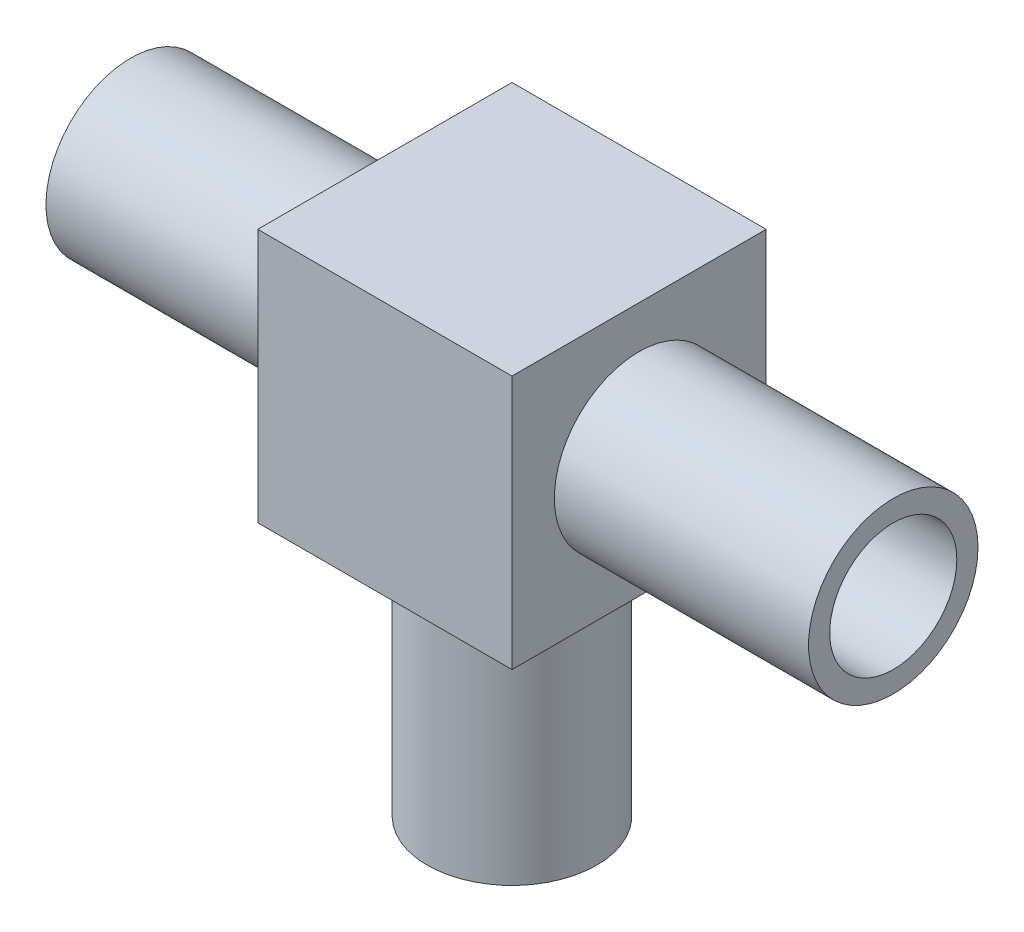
ISO-10303-21;
HEADER;
FILE_DESCRIPTION(('STEP AP214'),'2;1');
FILE_NAME('part.step','',(''),(''),'','','');
FILE_SCHEMA(('AUTOMOTIVE_DESIGN { 1 0 10303 214 1 1 1 1 }'));
ENDSEC;
DATA;
#1=APPLICATION_CONTEXT('core data for automotive mechanical design processes');
#2=APPLICATION_PROTOCOL_DEFINITION('international standard','automotive_design',2000,#1);
#3=PRODUCT_CONTEXT('',#1,'mechanical');
#4=PRODUCT('Part','Part','',(#3));
#5=PRODUCT_RELATED_PRODUCT_CATEGORY('part','',(#4));
#6=PRODUCT_DEFINITION_FORMATION('','',#4);
#7=PRODUCT_DEFINITION_CONTEXT('part definition',#1,'design');
#8=PRODUCT_DEFINITION('design','',#6,#7);
#9=PRODUCT_DEFINITION_SHAPE('','',#8);
#10=(LENGTH_UNIT() NAMED_UNIT(*) SI_UNIT(.MILLI.,.METRE.));
#11=(NAMED_UNIT(*) PLANE_ANGLE_UNIT() SI_UNIT($,.RADIAN.));
#12=(NAMED_UNIT(*) SI_UNIT($,.STERADIAN.) SOLID_ANGLE_UNIT());
#13=UNCERTAINTY_MEASURE_WITH_UNIT(LENGTH_MEASURE(1.E-05),#10,'distance_accuracy_value','');
#14=(GEOMETRIC_REPRESENTATION_CONTEXT(3) GLOBAL_UNCERTAINTY_ASSIGNED_CONTEXT((#13)) GLOBAL_UNIT_ASSIGNED_CONTEXT((#10,
#11,#12)) REPRESENTATION_CONTEXT('',''));
#15=CARTESIAN_POINT('',(0.,0.,0.));
#16=DIRECTION('',(0.,0.,1.));
#17=DIRECTION('',(1.,0.,0.));
#18=AXIS2_PLACEMENT_3D('',#15,#16,#17);
#19=CARTESIAN_POINT('',(-3.00000000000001,-3.,-3.));
#20=DIRECTION('',(0.,-1.,0.));
#21=DIRECTION('',(1.,0.,0.));
#22=AXIS2_PLACEMENT_3D('',#19,#20,#21);
#23=PLANE('',#22);
#24=DIRECTION('',(0.,0.,1.));
#25=VECTOR('',#24,1.);
#26=CARTESIAN_POINT('',(3.,-3.,-3.));
#27=LINE('',#26,#25);
#28=CARTESIAN_POINT('',(3.,-3.,-3.));
#29=VERTEX_POINT('',#28);
#30=CARTESIAN_POINT('',(3.,-3.,3.));
#31=VERTEX_POINT('',#30);
#32=EDGE_CURVE('E143',#29,#31,#27,.T.);
#33=ORIENTED_EDGE('',*,*,#32,.T.);
#34=DIRECTION('',(1.,0.,0.));
#35=VECTOR('',#34,1.);
#36=CARTESIAN_POINT('',(-3.00000000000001,-3.,3.));
#37=LINE('',#36,#35);
#38=CARTESIAN_POINT('',(-3.00000000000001,-3.,3.));
#39=VERTEX_POINT('',#38);
#40=EDGE_CURVE('E119',#39,#31,#37,.T.);
#41=ORIENTED_EDGE('',*,*,#40,.F.);
#42=DIRECTION('',(0.,0.,1.));
#43=VECTOR('',#42,1.);
#44=CARTESIAN_POINT('',(-3.00000000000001,-3.,-3.));
#45=LINE('',#44,#43);
#46=CARTESIAN_POINT('',(-3.00000000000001,-3.,-3.));
#47=VERTEX_POINT('',#46);
#48=EDGE_CURVE('E139',#47,#39,#45,.T.);
#49=ORIENTED_EDGE('',*,*,#48,.F.);
#50=DIRECTION('',(1.,0.,0.));
#51=VECTOR('',#50,1.);
#52=CARTESIAN_POINT('',(-3.00000000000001,-3.,-3.));
#53=LINE('',#52,#51);
#54=EDGE_CURVE('E130',#47,#29,#53,.T.);
#55=ORIENTED_EDGE('',*,*,#54,.T.);
#56=EDGE_LOOP('',(#33,#41,#49,#55));
#57=FACE_BOUND('',#56,.T.);
#58=CARTESIAN_POINT('',(0.,-3.,0.));
#59=DIRECTION('',(0.,-1.,0.));
#60=DIRECTION('',(1.,0.,0.));
#61=AXIS2_PLACEMENT_3D('',#58,#59,#60);
#62=CIRCLE('',#61,2.);
#63=CARTESIAN_POINT('',(2.,-3.,0.));
#64=VERTEX_POINT('',#63);
#65=EDGE_CURVE('E94',#64,#64,#62,.T.);
#66=ORIENTED_EDGE('',*,*,#65,.F.);
#67=EDGE_LOOP('',(#66));
#68=FACE_BOUND('',#67,.T.);
#69=ADVANCED_FACE('F34',(#57,#68),#23,.T.);
#70=CARTESIAN_POINT('',(3.,3.,-3.));
#71=DIRECTION('',(1.,0.,0.));
#72=DIRECTION('',(0.,0.,-1.));
#73=AXIS2_PLACEMENT_3D('',#70,#71,#72);
#74=PLANE('',#73);
#75=DIRECTION('',(0.,0.,1.));
#76=VECTOR('',#75,1.);
#77=CARTESIAN_POINT('',(3.,3.,-3.));
#78=LINE('',#77,#76);
#79=CARTESIAN_POINT('',(3.,3.,-3.));
#80=VERTEX_POINT('',#79);
#81=CARTESIAN_POINT('',(3.,3.,3.));
#82=VERTEX_POINT('',#81);
#83=EDGE_CURVE('E141',#80,#82,#78,.T.);
#84=ORIENTED_EDGE('',*,*,#83,.T.);
#85=DIRECTION('',(0.,1.,0.));
#86=VECTOR('',#85,1.);
#87=CARTESIAN_POINT('',(3.,3.,3.));
#88=LINE('',#87,#86);
#89=EDGE_CURVE('E122',#31,#82,#88,.T.);
#90=ORIENTED_EDGE('',*,*,#89,.F.);
#91=ORIENTED_EDGE('',*,*,#32,.F.);
#92=DIRECTION('',(0.,1.,0.));
#93=VECTOR('',#92,1.);
#94=CARTESIAN_POINT('',(3.,3.,-3.));
#95=LINE('',#94,#93);
#96=EDGE_CURVE('E133',#29,#80,#95,.T.);
#97=ORIENTED_EDGE('',*,*,#96,.T.);
#98=EDGE_LOOP('',(#84,#90,#91,#97));
#99=FACE_BOUND('',#98,.T.);
#100=CARTESIAN_POINT('',(3.,0.,0.));
#101=DIRECTION('',(1.,0.,0.));
#102=DIRECTION('',(0.,0.,-1.));
#103=AXIS2_PLACEMENT_3D('',#100,#101,#102);
#104=CIRCLE('',#103,2.);
#105=CARTESIAN_POINT('',(3.,0.,-2.));
#106=VERTEX_POINT('',#105);
#107=EDGE_CURVE('E102',#106,#106,#104,.T.);
#108=ORIENTED_EDGE('',*,*,#107,.F.);
#109=EDGE_LOOP('',(#108));
#110=FACE_BOUND('',#109,.T.);
#111=ADVANCED_FACE('F161',(#99,#110),#74,.T.);
#112=CARTESIAN_POINT('',(-3.,3.,-3.));
#113=DIRECTION('',(-1.,0.,0.));
#114=DIRECTION('',(0.,-1.,0.));
#115=AXIS2_PLACEMENT_3D('',#112,#113,#114);
#116=PLANE('',#115);
#117=ORIENTED_EDGE('',*,*,#48,.T.);
#118=DIRECTION('',(0.,-1.,0.));
#119=VECTOR('',#118,1.);
#120=CARTESIAN_POINT('',(-3.,3.,3.));
#121=LINE('',#120,#119);
#122=CARTESIAN_POINT('',(-3.,3.,3.));
#123=VERTEX_POINT('',#122);
#124=EDGE_CURVE('E114',#123,#39,#121,.T.);
#125=ORIENTED_EDGE('',*,*,#124,.F.);
#126=DIRECTION('',(0.,0.,1.));
#127=VECTOR('',#126,1.);
#128=CARTESIAN_POINT('',(-3.,3.,-3.));
#129=LINE('',#128,#127);
#130=CARTESIAN_POINT('',(-3.,3.,-3.));
#131=VERTEX_POINT('',#130);
#132=EDGE_CURVE('E54',#131,#123,#129,.T.);
#133=ORIENTED_EDGE('',*,*,#132,.F.);
#134=DIRECTION('',(0.,-1.,0.));
#135=VECTOR('',#134,1.);
#136=CARTESIAN_POINT('',(-3.,3.,-3.));
#137=LINE('',#136,#135);
#138=EDGE_CURVE('E128',#131,#47,#137,.T.);
#139=ORIENTED_EDGE('',*,*,#138,.T.);
#140=EDGE_LOOP('',(#117,#125,#133,#139));
#141=FACE_BOUND('',#140,.T.);
#142=CARTESIAN_POINT('',(-3.,0.,0.));
#143=DIRECTION('',(-1.,0.,0.));
#144=DIRECTION('',(0.,-1.,0.));
#145=AXIS2_PLACEMENT_3D('',#142,#143,#144);
#146=CIRCLE('',#145,2.);
#147=CARTESIAN_POINT('',(-3.00000000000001,-2.,0.));
#148=VERTEX_POINT('',#147);
#149=EDGE_CURVE('E108',#148,#148,#146,.T.);
#150=ORIENTED_EDGE('',*,*,#149,.F.);
#151=EDGE_LOOP('',(#150));
#152=FACE_BOUND('',#151,.T.);
#153=ADVANCED_FACE('F36',(#141,#152),#116,.T.);
#154=CARTESIAN_POINT('',(-3.,3.,-3.));
#155=DIRECTION('',(0.,1.,0.));
#156=DIRECTION('',(0.,0.,1.));
#157=AXIS2_PLACEMENT_3D('',#154,#155,#156);
#158=PLANE('',#157);
#159=ORIENTED_EDGE('',*,*,#132,.T.);
#160=DIRECTION('',(-1.,0.,0.));
#161=VECTOR('',#160,1.);
#162=CARTESIAN_POINT('',(-3.,3.,3.));
#163=LINE('',#162,#161);
#164=EDGE_CURVE('E125',#82,#123,#163,.T.);
#165=ORIENTED_EDGE('',*,*,#164,.F.);
#166=ORIENTED_EDGE('',*,*,#83,.F.);
#167=DIRECTION('',(-1.,0.,0.));
#168=VECTOR('',#167,1.);
#169=CARTESIAN_POINT('',(-3.,3.,-3.));
#170=LINE('',#169,#168);
#171=EDGE_CURVE('E136',#80,#131,#170,.T.);
#172=ORIENTED_EDGE('',*,*,#171,.T.);
#173=EDGE_LOOP('',(#159,#165,#166,#172));
#174=FACE_BOUND('',#173,.T.);
#175=ADVANCED_FACE('F155',(#174),#158,.T.);
#176=CARTESIAN_POINT('',(-3.00000000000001,-3.,-3.));
#177=DIRECTION('',(0.,0.,1.));
#178=DIRECTION('',(1.,0.,0.));
#179=AXIS2_PLACEMENT_3D('',#176,#177,#178);
#180=PLANE('',#179);
#181=ORIENTED_EDGE('',*,*,#138,.F.);
#182=ORIENTED_EDGE('',*,*,#171,.F.);
#183=ORIENTED_EDGE('',*,*,#96,.F.);
#184=ORIENTED_EDGE('',*,*,#54,.F.);
#185=EDGE_LOOP('',(#181,#182,#183,#184));
#186=FACE_BOUND('',#185,.T.);
#187=ADVANCED_FACE('F159',(#186),#180,.F.);
#188=CARTESIAN_POINT('',(-3.00000000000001,-3.,3.));
#189=DIRECTION('',(0.,0.,1.));
#190=DIRECTION('',(1.,0.,0.));
#191=AXIS2_PLACEMENT_3D('',#188,#189,#190);
#192=PLANE('',#191);
#193=ORIENTED_EDGE('',*,*,#124,.T.);
#194=ORIENTED_EDGE('',*,*,#40,.T.);
#195=ORIENTED_EDGE('',*,*,#89,.T.);
#196=ORIENTED_EDGE('',*,*,#164,.T.);
#197=EDGE_LOOP('',(#193,#194,#195,#196));
#198=FACE_BOUND('',#197,.T.);
#199=ADVANCED_FACE('F152',(#198),#192,.T.);
#200=CARTESIAN_POINT('',(-9.00000000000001,0.,0.));
#201=DIRECTION('',(1.,0.,0.));
#202=DIRECTION('',(0.,1.,0.));
#203=AXIS2_PLACEMENT_3D('',#200,#201,#202);
#204=CYLINDRICAL_SURFACE('',#203,2.);
#205=CARTESIAN_POINT('',(-9.00000000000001,0.,0.));
#206=DIRECTION('',(-1.,0.,0.));
#207=DIRECTION('',(0.,-1.,0.));
#208=AXIS2_PLACEMENT_3D('',#205,#206,#207);
#209=CIRCLE('',#208,2.);
#210=CARTESIAN_POINT('',(-9.00000000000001,-1.99999999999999,0.));
#211=VERTEX_POINT('',#210);
#212=EDGE_CURVE('E111',#211,#211,#209,.T.);
#213=ORIENTED_EDGE('',*,*,#212,.F.);
#214=EDGE_LOOP('',(#213));
#215=FACE_BOUND('',#214,.T.);
#216=ORIENTED_EDGE('',*,*,#149,.T.);
#217=EDGE_LOOP('',(#216));
#218=FACE_BOUND('',#217,.T.);
#219=ADVANCED_FACE('F179',(#215,#218),#204,.T.);
#220=CARTESIAN_POINT('',(-9.00000000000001,0.,0.));
#221=DIRECTION('',(-1.,0.,0.));
#222=DIRECTION('',(0.,-1.,0.));
#223=AXIS2_PLACEMENT_3D('',#220,#221,#222);
#224=PLANE('',#223);
#225=CARTESIAN_POINT('',(-9.00000000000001,0.,0.));
#226=DIRECTION('',(1.,0.,0.));
#227=DIRECTION('',(0.,0.,-1.));
#228=AXIS2_PLACEMENT_3D('',#225,#226,#227);
#229=CIRCLE('',#228,1.5);
#230=CARTESIAN_POINT('',(-9.00000000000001,0.,-1.5));
#231=VERTEX_POINT('',#230);
#232=EDGE_CURVE('E87',#231,#231,#229,.T.);
#233=ORIENTED_EDGE('',*,*,#232,.T.);
#234=EDGE_LOOP('',(#233));
#235=FACE_BOUND('',#234,.T.);
#236=ORIENTED_EDGE('',*,*,#212,.T.);
#237=EDGE_LOOP('',(#236));
#238=FACE_BOUND('',#237,.T.);
#239=ADVANCED_FACE('F170',(#235,#238),#224,.T.);
#240=CARTESIAN_POINT('',(9.,0.,0.));
#241=DIRECTION('',(-1.,0.,0.));
#242=DIRECTION('',(0.,0.,1.));
#243=AXIS2_PLACEMENT_3D('',#240,#241,#242);
#244=CYLINDRICAL_SURFACE('',#243,2.);
#245=CARTESIAN_POINT('',(9.,0.,0.));
#246=DIRECTION('',(1.,0.,0.));
#247=DIRECTION('',(0.,0.,-1.));
#248=AXIS2_PLACEMENT_3D('',#245,#246,#247);
#249=CIRCLE('',#248,2.);
#250=CARTESIAN_POINT('',(9.,0.,-2.));
#251=VERTEX_POINT('',#250);
#252=EDGE_CURVE('E105',#251,#251,#249,.T.);
#253=ORIENTED_EDGE('',*,*,#252,.F.);
#254=EDGE_LOOP('',(#253));
#255=FACE_BOUND('',#254,.T.);
#256=ORIENTED_EDGE('',*,*,#107,.T.);
#257=EDGE_LOOP('',(#256));
#258=FACE_BOUND('',#257,.T.);
#259=ADVANCED_FACE('F167',(#255,#258),#244,.T.);
#260=CARTESIAN_POINT('',(9.,0.,0.));
#261=DIRECTION('',(1.,0.,0.));
#262=DIRECTION('',(0.,0.,-1.));
#263=AXIS2_PLACEMENT_3D('',#260,#261,#262);
#264=PLANE('',#263);
#265=CARTESIAN_POINT('',(9.,0.,0.));
#266=DIRECTION('',(1.,0.,0.));
#267=DIRECTION('',(0.,0.,-1.));
#268=AXIS2_PLACEMENT_3D('',#265,#266,#267);
#269=CIRCLE('',#268,1.5);
#270=CARTESIAN_POINT('',(9.,0.,-1.5));
#271=VERTEX_POINT('',#270);
#272=EDGE_CURVE('E90',#271,#271,#269,.T.);
#273=ORIENTED_EDGE('',*,*,#272,.F.);
#274=EDGE_LOOP('',(#273));
#275=FACE_BOUND('',#274,.T.);
#276=ORIENTED_EDGE('',*,*,#252,.T.);
#277=EDGE_LOOP('',(#276));
#278=FACE_BOUND('',#277,.T.);
#279=ADVANCED_FACE('F169',(#275,#278),#264,.T.);
#280=CARTESIAN_POINT('',(0.,-9.,0.));
#281=DIRECTION('',(0.,1.,0.));
#282=DIRECTION('',(-1.,0.,0.));
#283=AXIS2_PLACEMENT_3D('',#280,#281,#282);
#284=CYLINDRICAL_SURFACE('',#283,2.);
#285=CARTESIAN_POINT('',(0.,-9.,0.));
#286=DIRECTION('',(0.,-1.,0.));
#287=DIRECTION('',(1.,0.,0.));
#288=AXIS2_PLACEMENT_3D('',#285,#286,#287);
#289=CIRCLE('',#288,2.);
#290=CARTESIAN_POINT('',(1.99999999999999,-9.,0.));
#291=VERTEX_POINT('',#290);
#292=EDGE_CURVE('E99',#291,#291,#289,.T.);
#293=ORIENTED_EDGE('',*,*,#292,.F.);
#294=EDGE_LOOP('',(#293));
#295=FACE_BOUND('',#294,.T.);
#296=ORIENTED_EDGE('',*,*,#65,.T.);
#297=EDGE_LOOP('',(#296));
#298=FACE_BOUND('',#297,.T.);
#299=ADVANCED_FACE('F177',(#295,#298),#284,.T.);
#300=CARTESIAN_POINT('',(0.,-9.,0.));
#301=DIRECTION('',(0.,-1.,0.));
#302=DIRECTION('',(1.,0.,0.));
#303=AXIS2_PLACEMENT_3D('',#300,#301,#302);
#304=PLANE('',#303);
#305=CARTESIAN_POINT('',(0.,-9.,0.));
#306=DIRECTION('',(0.,-1.,0.));
#307=DIRECTION('',(1.,0.,0.));
#308=AXIS2_PLACEMENT_3D('',#305,#306,#307);
#309=CIRCLE('',#308,1.5);
#310=CARTESIAN_POINT('',(1.5,-9.,0.));
#311=VERTEX_POINT('',#310);
#312=EDGE_CURVE('E92',#311,#311,#309,.T.);
#313=ORIENTED_EDGE('',*,*,#312,.F.);
#314=EDGE_LOOP('',(#313));
#315=FACE_BOUND('',#314,.T.);
#316=ORIENTED_EDGE('',*,*,#292,.T.);
#317=EDGE_LOOP('',(#316));
#318=FACE_BOUND('',#317,.T.);
#319=ADVANCED_FACE('F82',(#315,#318),#304,.T.);
#320=CARTESIAN_POINT('',(-9.00000000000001,0.,0.));
#321=DIRECTION('',(1.,0.,0.));
#322=DIRECTION('',(0.,0.,-1.));
#323=AXIS2_PLACEMENT_3D('',#320,#321,#322);
#324=CYLINDRICAL_SURFACE('',#323,1.5);
#325=CARTESIAN_POINT('',(0.,0.,0.));
#326=DIRECTION('',(0.707106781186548,0.707106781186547,0.));
#327=DIRECTION('',(0.707106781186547,-0.707106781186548,0.));
#328=AXIS2_PLACEMENT_3D('',#325,#326,#327);
#329=ELLIPSE('',#328,2.12132034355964,1.5);
#330=CARTESIAN_POINT('',(0.,0.,-1.5));
#331=VERTEX_POINT('',#330);
#332=CARTESIAN_POINT('',(0.,0.,1.5));
#333=VERTEX_POINT('',#332);
#334=EDGE_CURVE('E42',#331,#333,#329,.F.);
#335=ORIENTED_EDGE('',*,*,#334,.T.);
#336=CARTESIAN_POINT('',(0.,0.,0.));
#337=DIRECTION('',(0.707106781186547,-0.707106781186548,0.));
#338=DIRECTION('',(0.707106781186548,0.707106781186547,0.));
#339=AXIS2_PLACEMENT_3D('',#336,#337,#338);
#340=ELLIPSE('',#339,2.12132034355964,1.5);
#341=EDGE_CURVE('E11',#333,#331,#340,.T.);
#342=ORIENTED_EDGE('',*,*,#341,.T.);
#343=EDGE_LOOP('',(#335,#342));
#344=FACE_BOUND('',#343,.T.);
#345=ORIENTED_EDGE('',*,*,#232,.F.);
#346=EDGE_LOOP('',(#345));
#347=FACE_BOUND('',#346,.T.);
#348=ORIENTED_EDGE('',*,*,#272,.T.);
#349=EDGE_LOOP('',(#348));
#350=FACE_BOUND('',#349,.T.);
#351=ADVANCED_FACE('F79',(#344,#347,#350),#324,.F.);
#352=CARTESIAN_POINT('',(0.,0.,0.));
#353=DIRECTION('',(0.,-1.,0.));
#354=DIRECTION('',(1.,0.,0.));
#355=AXIS2_PLACEMENT_3D('',#352,#353,#354);
#356=CYLINDRICAL_SURFACE('',#355,1.5);
#357=ORIENTED_EDGE('',*,*,#312,.T.);
#358=EDGE_LOOP('',(#357));
#359=FACE_BOUND('',#358,.T.);
#360=ORIENTED_EDGE('',*,*,#334,.F.);
#361=ORIENTED_EDGE('',*,*,#341,.F.);
#362=EDGE_LOOP('',(#360,#361));
#363=FACE_BOUND('',#362,.T.);
#364=ADVANCED_FACE('F77',(#359,#363),#356,.F.);
#365=CLOSED_SHELL('',(#69,#111,#153,#175,#187,#199,#219,#239,#259,#279,#299,#319,#351,#364));
#366=MANIFOLD_SOLID_BREP('B2',#365);
#367=ADVANCED_BREP_SHAPE_REPRESENTATION('',(#18,#366),#14);
#368=SHAPE_DEFINITION_REPRESENTATION(#9,#367);
ENDSEC;
END-ISO-10303-21;
